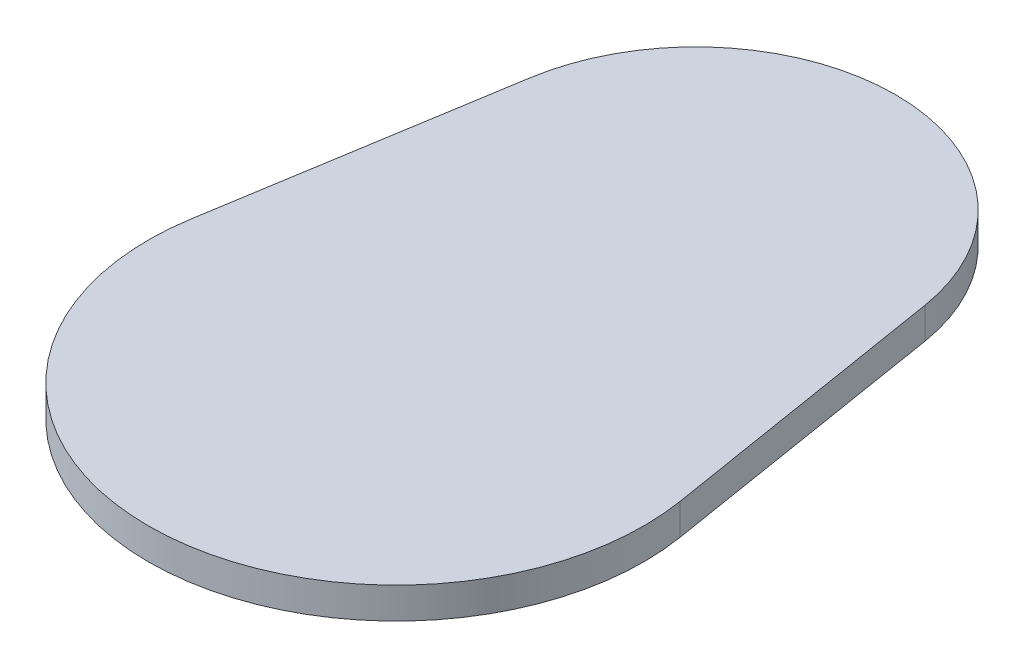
ISO-10303-21;
HEADER;
FILE_DESCRIPTION(('STEP AP214'),'2;1');
FILE_NAME('part.step','',(''),(''),'','','');
FILE_SCHEMA(('AUTOMOTIVE_DESIGN { 1 0 10303 214 1 1 1 1 }'));
ENDSEC;
DATA;
#1=APPLICATION_CONTEXT('core data for automotive mechanical design processes');
#2=APPLICATION_PROTOCOL_DEFINITION('international standard','automotive_design',2000,#1);
#3=PRODUCT_CONTEXT('',#1,'mechanical');
#4=PRODUCT('Part','Part','',(#3));
#5=PRODUCT_RELATED_PRODUCT_CATEGORY('part','',(#4));
#6=PRODUCT_DEFINITION_FORMATION('','',#4);
#7=PRODUCT_DEFINITION_CONTEXT('part definition',#1,'design');
#8=PRODUCT_DEFINITION('design','',#6,#7);
#9=PRODUCT_DEFINITION_SHAPE('','',#8);
#10=(LENGTH_UNIT() NAMED_UNIT(*) SI_UNIT(.MILLI.,.METRE.));
#11=(NAMED_UNIT(*) PLANE_ANGLE_UNIT() SI_UNIT($,.RADIAN.));
#12=(NAMED_UNIT(*) SI_UNIT($,.STERADIAN.) SOLID_ANGLE_UNIT());
#13=UNCERTAINTY_MEASURE_WITH_UNIT(LENGTH_MEASURE(1.E-05),#10,'distance_accuracy_value','');
#14=(GEOMETRIC_REPRESENTATION_CONTEXT(3) GLOBAL_UNCERTAINTY_ASSIGNED_CONTEXT((#13)) GLOBAL_UNIT_ASSIGNED_CONTEXT((#10,
#11,#12)) REPRESENTATION_CONTEXT('',''));
#15=CARTESIAN_POINT('',(0.,0.,0.));
#16=DIRECTION('',(0.,0.,1.));
#17=DIRECTION('',(1.,0.,0.));
#18=AXIS2_PLACEMENT_3D('',#15,#16,#17);
#19=CARTESIAN_POINT('',(0.,1.9812,0.));
#20=DIRECTION('',(0.,-1.,0.));
#21=DIRECTION('',(0.,0.,-1.));
#22=AXIS2_PLACEMENT_3D('',#19,#20,#21);
#23=CYLINDRICAL_SURFACE('',#22,12.7);
#24=CARTESIAN_POINT('',(0.,0.,0.));
#25=DIRECTION('',(0.,1.,0.));
#26=DIRECTION('',(0.,0.,-1.));
#27=AXIS2_PLACEMENT_3D('',#24,#25,#26);
#28=CIRCLE('',#27,12.7);
#29=CARTESIAN_POINT('',(12.5363860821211,0.,-2.032));
#30=VERTEX_POINT('',#29);
#31=CARTESIAN_POINT('',(-12.5363860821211,0.,-2.032));
#32=VERTEX_POINT('',#31);
#33=EDGE_CURVE('E70',#30,#32,#28,.T.);
#34=ORIENTED_EDGE('',*,*,#33,.T.);
#35=DIRECTION('',(0.,-1.,0.));
#36=VECTOR('',#35,1.);
#37=CARTESIAN_POINT('',(-12.5363860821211,1.9812,-2.032));
#38=LINE('',#37,#36);
#39=CARTESIAN_POINT('',(-12.5363860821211,1.9812,-2.032));
#40=VERTEX_POINT('',#39);
#41=EDGE_CURVE('E11',#40,#32,#38,.T.);
#42=ORIENTED_EDGE('',*,*,#41,.F.);
#43=CARTESIAN_POINT('',(0.,1.9812,0.));
#44=DIRECTION('',(0.,1.,0.));
#45=DIRECTION('',(0.,0.,-1.));
#46=AXIS2_PLACEMENT_3D('',#43,#44,#45);
#47=CIRCLE('',#46,12.7);
#48=CARTESIAN_POINT('',(12.5363860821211,1.9812,-2.032));
#49=VERTEX_POINT('',#48);
#50=EDGE_CURVE('E88',#49,#40,#47,.T.);
#51=ORIENTED_EDGE('',*,*,#50,.F.);
#52=DIRECTION('',(0.,-1.,0.));
#53=VECTOR('',#52,1.);
#54=CARTESIAN_POINT('',(12.5363860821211,1.9812,-2.032));
#55=LINE('',#54,#53);
#56=EDGE_CURVE('E82',#49,#30,#55,.T.);
#57=ORIENTED_EDGE('',*,*,#56,.T.);
#58=EDGE_LOOP('',(#34,#42,#51,#57));
#59=FACE_BOUND('',#58,.T.);
#60=ADVANCED_FACE('F26',(#59),#23,.T.);
#61=CARTESIAN_POINT('',(-15.5451187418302,1.9812,16.53032));
#62=DIRECTION('',(0.987117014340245,0.,0.16));
#63=DIRECTION('',(0.16,0.,-0.987117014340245));
#64=AXIS2_PLACEMENT_3D('',#61,#62,#63);
#65=PLANE('',#64);
#66=DIRECTION('',(-0.16,0.,0.987117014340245));
#67=VECTOR('',#66,1.);
#68=CARTESIAN_POINT('',(-15.5451187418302,0.,16.53032));
#69=LINE('',#68,#67);
#70=CARTESIAN_POINT('',(-15.5451187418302,0.,16.53032));
#71=VERTEX_POINT('',#70);
#72=EDGE_CURVE('E66',#32,#71,#69,.T.);
#73=ORIENTED_EDGE('',*,*,#72,.T.);
#74=DIRECTION('',(0.,-1.,0.));
#75=VECTOR('',#74,1.);
#76=CARTESIAN_POINT('',(-15.5451187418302,1.9812,16.53032));
#77=LINE('',#76,#75);
#78=CARTESIAN_POINT('',(-15.5451187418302,1.9812,16.53032));
#79=VERTEX_POINT('',#78);
#80=EDGE_CURVE('E33',#79,#71,#77,.T.);
#81=ORIENTED_EDGE('',*,*,#80,.F.);
#82=DIRECTION('',(-0.16,0.,0.987117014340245));
#83=VECTOR('',#82,1.);
#84=CARTESIAN_POINT('',(-15.5451187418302,1.9812,16.53032));
#85=LINE('',#84,#83);
#86=EDGE_CURVE('E78',#40,#79,#85,.T.);
#87=ORIENTED_EDGE('',*,*,#86,.F.);
#88=ORIENTED_EDGE('',*,*,#41,.T.);
#89=EDGE_LOOP('',(#73,#81,#87,#88));
#90=FACE_BOUND('',#89,.T.);
#91=ADVANCED_FACE('F77',(#90),#65,.F.);
#92=CARTESIAN_POINT('',(0.,1.9812,19.05));
#93=DIRECTION('',(0.,-1.,0.));
#94=DIRECTION('',(0.,0.,-1.));
#95=AXIS2_PLACEMENT_3D('',#92,#93,#94);
#96=CYLINDRICAL_SURFACE('',#95,15.748);
#97=CARTESIAN_POINT('',(0.,0.,19.05));
#98=DIRECTION('',(0.,1.,0.));
#99=DIRECTION('',(0.,0.,-1.));
#100=AXIS2_PLACEMENT_3D('',#97,#98,#99);
#101=CIRCLE('',#100,15.748);
#102=CARTESIAN_POINT('',(15.5451187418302,0.,16.53032));
#103=VERTEX_POINT('',#102);
#104=EDGE_CURVE('E71',#71,#103,#101,.T.);
#105=ORIENTED_EDGE('',*,*,#104,.T.);
#106=DIRECTION('',(0.,-1.,0.));
#107=VECTOR('',#106,1.);
#108=CARTESIAN_POINT('',(15.5451187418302,1.9812,16.53032));
#109=LINE('',#108,#107);
#110=CARTESIAN_POINT('',(15.5451187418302,1.9812,16.53032));
#111=VERTEX_POINT('',#110);
#112=EDGE_CURVE('E94',#111,#103,#109,.T.);
#113=ORIENTED_EDGE('',*,*,#112,.F.);
#114=CARTESIAN_POINT('',(0.,1.9812,19.05));
#115=DIRECTION('',(0.,1.,0.));
#116=DIRECTION('',(0.,0.,-1.));
#117=AXIS2_PLACEMENT_3D('',#114,#115,#116);
#118=CIRCLE('',#117,15.748);
#119=EDGE_CURVE('E45',#79,#111,#118,.T.);
#120=ORIENTED_EDGE('',*,*,#119,.F.);
#121=ORIENTED_EDGE('',*,*,#80,.T.);
#122=EDGE_LOOP('',(#105,#113,#120,#121));
#123=FACE_BOUND('',#122,.T.);
#124=ADVANCED_FACE('F97',(#123),#96,.T.);
#125=CARTESIAN_POINT('',(12.5363860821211,1.9812,-2.032));
#126=DIRECTION('',(-0.987117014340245,0.,0.16));
#127=DIRECTION('',(0.16,0.,0.987117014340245));
#128=AXIS2_PLACEMENT_3D('',#125,#126,#127);
#129=PLANE('',#128);
#130=DIRECTION('',(-0.16,0.,-0.987117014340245));
#131=VECTOR('',#130,1.);
#132=CARTESIAN_POINT('',(12.5363860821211,0.,-2.032));
#133=LINE('',#132,#131);
#134=EDGE_CURVE('E86',#103,#30,#133,.T.);
#135=ORIENTED_EDGE('',*,*,#134,.T.);
#136=ORIENTED_EDGE('',*,*,#56,.F.);
#137=DIRECTION('',(-0.16,0.,-0.987117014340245));
#138=VECTOR('',#137,1.);
#139=CARTESIAN_POINT('',(12.5363860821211,1.9812,-2.032));
#140=LINE('',#139,#138);
#141=EDGE_CURVE('E40',#111,#49,#140,.T.);
#142=ORIENTED_EDGE('',*,*,#141,.F.);
#143=ORIENTED_EDGE('',*,*,#112,.T.);
#144=EDGE_LOOP('',(#135,#136,#142,#143));
#145=FACE_BOUND('',#144,.T.);
#146=ADVANCED_FACE('F99',(#145),#129,.F.);
#147=CARTESIAN_POINT('',(0.,1.9812,0.));
#148=DIRECTION('',(0.,-1.,0.));
#149=DIRECTION('',(0.,0.,-1.));
#150=AXIS2_PLACEMENT_3D('',#147,#148,#149);
#151=PLANE('',#150);
#152=ORIENTED_EDGE('',*,*,#50,.T.);
#153=ORIENTED_EDGE('',*,*,#86,.T.);
#154=ORIENTED_EDGE('',*,*,#119,.T.);
#155=ORIENTED_EDGE('',*,*,#141,.T.);
#156=EDGE_LOOP('',(#152,#153,#154,#155));
#157=FACE_BOUND('',#156,.T.);
#158=ADVANCED_FACE('F100',(#157),#151,.F.);
#159=CARTESIAN_POINT('',(0.,0.,0.));
#160=DIRECTION('',(0.,-1.,0.));
#161=DIRECTION('',(0.,0.,-1.));
#162=AXIS2_PLACEMENT_3D('',#159,#160,#161);
#163=PLANE('',#162);
#164=ORIENTED_EDGE('',*,*,#33,.F.);
#165=ORIENTED_EDGE('',*,*,#134,.F.);
#166=ORIENTED_EDGE('',*,*,#104,.F.);
#167=ORIENTED_EDGE('',*,*,#72,.F.);
#168=EDGE_LOOP('',(#164,#165,#166,#167));
#169=FACE_BOUND('',#168,.T.);
#170=ADVANCED_FACE('F67',(#169),#163,.T.);
#171=CLOSED_SHELL('',(#60,#91,#124,#146,#158,#170));
#172=MANIFOLD_SOLID_BREP('B2',#171);
#173=ADVANCED_BREP_SHAPE_REPRESENTATION('',(#18,#172),#14);
#174=SHAPE_DEFINITION_REPRESENTATION(#9,#173);
ENDSEC;
END-ISO-10303-21;
